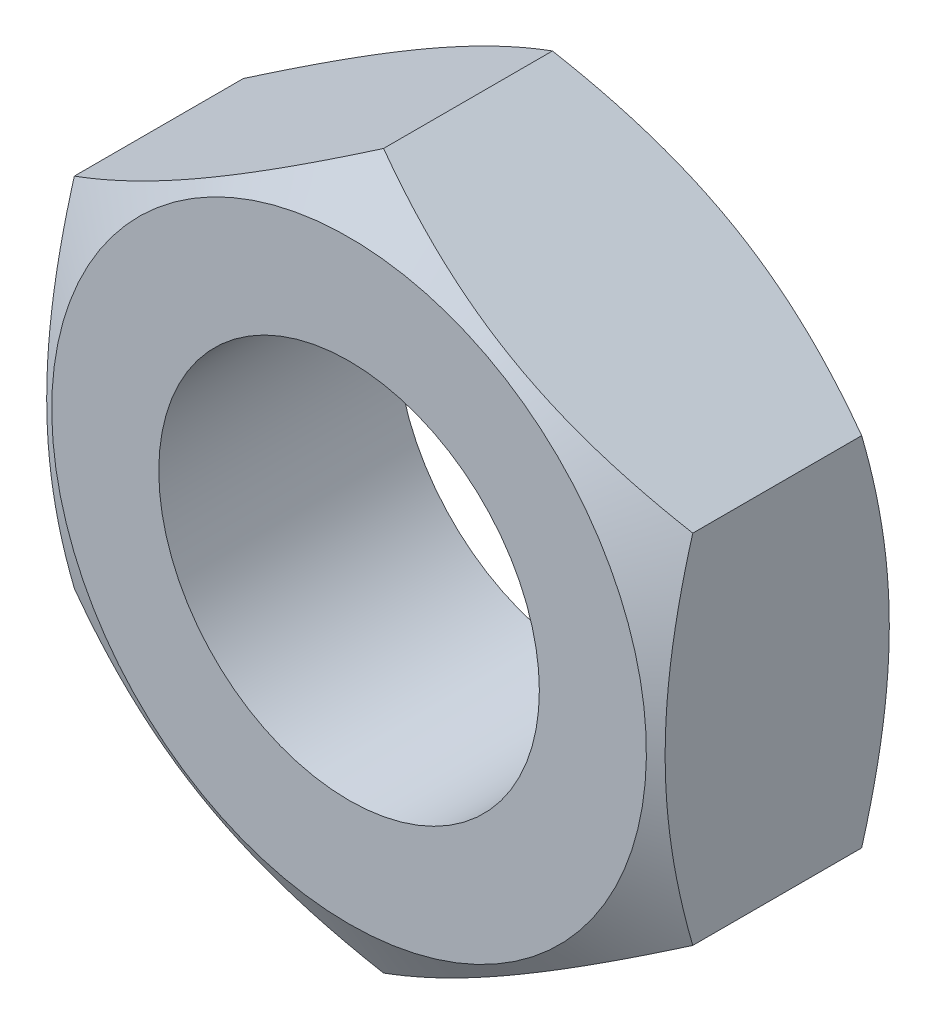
ISO-10303-21;
HEADER;
FILE_DESCRIPTION(('STEP AP214'),'2;1');
FILE_NAME('part.step','',(''),(''),'','','');
FILE_SCHEMA(('AUTOMOTIVE_DESIGN { 1 0 10303 214 1 1 1 1 }'));
ENDSEC;
DATA;
#1=APPLICATION_CONTEXT('core data for automotive mechanical design processes');
#2=APPLICATION_PROTOCOL_DEFINITION('international standard','automotive_design',2000,#1);
#3=PRODUCT_CONTEXT('',#1,'mechanical');
#4=PRODUCT('Part','Part','',(#3));
#5=PRODUCT_RELATED_PRODUCT_CATEGORY('part','',(#4));
#6=PRODUCT_DEFINITION_FORMATION('','',#4);
#7=PRODUCT_DEFINITION_CONTEXT('part definition',#1,'design');
#8=PRODUCT_DEFINITION('design','',#6,#7);
#9=PRODUCT_DEFINITION_SHAPE('','',#8);
#10=(LENGTH_UNIT() NAMED_UNIT(*) SI_UNIT(.MILLI.,.METRE.));
#11=(NAMED_UNIT(*) PLANE_ANGLE_UNIT() SI_UNIT($,.RADIAN.));
#12=(NAMED_UNIT(*) SI_UNIT($,.STERADIAN.) SOLID_ANGLE_UNIT());
#13=UNCERTAINTY_MEASURE_WITH_UNIT(LENGTH_MEASURE(1.E-05),#10,'distance_accuracy_value','');
#14=(GEOMETRIC_REPRESENTATION_CONTEXT(3) GLOBAL_UNCERTAINTY_ASSIGNED_CONTEXT((#13)) GLOBAL_UNIT_ASSIGNED_CONTEXT((#10,
#11,#12)) REPRESENTATION_CONTEXT('',''));
#15=CARTESIAN_POINT('',(0.,0.,0.));
#16=DIRECTION('',(0.,0.,1.));
#17=DIRECTION('',(1.,0.,0.));
#18=AXIS2_PLACEMENT_3D('',#15,#16,#17);
#19=CARTESIAN_POINT('',(-6.5,-3.75277674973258,6.5));
#20=DIRECTION('',(-1.,0.,0.));
#21=DIRECTION('',(0.,0.,1.));
#22=AXIS2_PLACEMENT_3D('',#19,#20,#21);
#23=PLANE('',#22);
#24=CARTESIAN_POINT('',(-6.5,-9.98161632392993,1.73135975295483));
#25=CARTESIAN_POINT('',(-6.5,-9.69852854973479,1.86828240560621));
#26=CARTESIAN_POINT('',(-6.5,-9.414780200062,2.00386324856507));
#27=CARTESIAN_POINT('',(-6.5,-8.84561064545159,2.27158457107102));
#28=CARTESIAN_POINT('',(-6.5,-8.56018917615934,2.4037244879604));
#29=CARTESIAN_POINT('',(-6.5,-7.98580311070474,2.66449331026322));
#30=CARTESIAN_POINT('',(-6.5,-7.69682761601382,2.79309829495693));
#31=CARTESIAN_POINT('',(-6.5,-7.11654332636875,3.04491136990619));
#32=CARTESIAN_POINT('',(-6.5,-6.82523464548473,3.16811972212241));
#33=CARTESIAN_POINT('',(-6.5,-6.23081437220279,3.41139721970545));
#34=CARTESIAN_POINT('',(-6.5,-5.92761517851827,3.53125353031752));
#35=CARTESIAN_POINT('',(-6.5,-5.31763401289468,3.76165336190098));
#36=CARTESIAN_POINT('',(-6.5,-5.01085163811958,3.87219582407));
#37=CARTESIAN_POINT('',(-6.5,-4.39381921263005,4.08099296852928));
#38=CARTESIAN_POINT('',(-6.5,-4.08357797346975,4.17927340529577));
#39=CARTESIAN_POINT('',(-6.5,-3.4586584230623,4.36032946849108));
#40=CARTESIAN_POINT('',(-6.5,-3.14398157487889,4.4431100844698));
#41=CARTESIAN_POINT('',(-6.5,-2.51168245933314,4.58868976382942));
#42=CARTESIAN_POINT('',(-6.5,-2.19408488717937,4.65159314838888));
#43=CARTESIAN_POINT('',(-6.5,-1.71487680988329,4.72826766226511));
#44=CARTESIAN_POINT('',(-6.5,-1.55465944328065,4.75088015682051));
#45=CARTESIAN_POINT('',(-6.5,-1.23346313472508,4.78976589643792));
#46=CARTESIAN_POINT('',(-6.5,-1.0724842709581,4.80603977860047));
#47=CARTESIAN_POINT('',(-6.5,-0.752038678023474,4.83172518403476));
#48=CARTESIAN_POINT('',(-6.5,-0.592578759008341,4.84122135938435));
#49=CARTESIAN_POINT('',(-6.5,-0.27340062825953,4.85346937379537));
#50=CARTESIAN_POINT('',(-6.5,-0.113682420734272,4.85622132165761));
#51=CARTESIAN_POINT('',(-6.5,0.205728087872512,4.85491540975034));
#52=CARTESIAN_POINT('',(-6.5,0.365420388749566,4.85085749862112));
#53=CARTESIAN_POINT('',(-6.5,0.684495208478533,4.83602921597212));
#54=CARTESIAN_POINT('',(-6.5,0.843877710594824,4.82525849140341));
#55=CARTESIAN_POINT('',(-6.5,1.22996758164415,4.79126101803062));
#56=CARTESIAN_POINT('',(-6.5,1.45638554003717,4.76468045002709));
#57=CARTESIAN_POINT('',(-6.5,1.90746467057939,4.69944596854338));
#58=CARTESIAN_POINT('',(-6.5,2.1321255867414,4.66079032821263));
#59=CARTESIAN_POINT('',(-6.5,2.80325882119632,4.5287671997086));
#60=CARTESIAN_POINT('',(-6.5,3.24661528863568,4.41936998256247));
#61=CARTESIAN_POINT('',(-6.5,3.90942824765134,4.23063137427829));
#62=CARTESIAN_POINT('',(-6.5,4.1323463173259,4.16275540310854));
#63=CARTESIAN_POINT('',(-6.5,4.57601591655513,4.02019482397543));
#64=CARTESIAN_POINT('',(-6.5,4.79676743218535,3.94551017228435));
#65=CARTESIAN_POINT('',(-6.5,5.23617812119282,3.79051034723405));
#66=CARTESIAN_POINT('',(-6.5,5.4548380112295,3.71019718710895));
#67=CARTESIAN_POINT('',(-6.5,5.89036250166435,3.54486115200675));
#68=CARTESIAN_POINT('',(-6.5,6.10722711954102,3.4598383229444));
#69=CARTESIAN_POINT('',(-6.5,6.60378303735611,3.25993527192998));
#70=CARTESIAN_POINT('',(-6.5,6.8829317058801,3.14370996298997));
#71=CARTESIAN_POINT('',(-6.5,7.438984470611,2.90599503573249));
#72=CARTESIAN_POINT('',(-6.5,7.71588845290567,2.78450515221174));
#73=CARTESIAN_POINT('',(-6.5,8.26784706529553,2.53727897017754));
#74=CARTESIAN_POINT('',(-6.5,8.54290136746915,2.41154194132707));
#75=CARTESIAN_POINT('',(-6.5,9.09141569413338,2.15663242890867));
#76=CARTESIAN_POINT('',(-6.5,9.36487568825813,2.0274598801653));
#77=CARTESIAN_POINT('',(-6.5,10.1837305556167,1.63552392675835));
#78=CARTESIAN_POINT('',(-6.5,10.7271149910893,1.36856241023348));
#79=CARTESIAN_POINT('',(-6.5,11.8100422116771,0.826959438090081));
#80=CARTESIAN_POINT('',(-6.5,12.3495848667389,0.552317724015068));
#81=CARTESIAN_POINT('',(-6.5,13.1354553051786,0.147197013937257));
#82=CARTESIAN_POINT('',(-6.5,13.3829075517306,0.0188929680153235));
#83=CARTESIAN_POINT('',(-6.5,13.8772755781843,-0.238734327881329));
#84=CARTESIAN_POINT('',(-6.5,14.1241913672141,-0.368057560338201));
#85=CARTESIAN_POINT('',(-6.5,14.8642590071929,-0.75736353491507));
#86=CARTESIAN_POINT('',(-6.5,15.356712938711,-1.01867315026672));
#87=CARTESIAN_POINT('',(-6.5,16.3390648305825,-1.54341314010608));
#88=CARTESIAN_POINT('',(-6.5,16.8289660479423,-1.80683742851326));
#89=CARTESIAN_POINT('',(-6.5,17.807579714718,-2.33582775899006));
#90=CARTESIAN_POINT('',(-6.5,18.2962922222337,-2.60139369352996));
#91=CARTESIAN_POINT('',(-6.5,18.7845625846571,-2.86776506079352));
#92=B_SPLINE_CURVE_WITH_KNOTS('',3,(#24,#25,#26,#27,#28,#29,#30,#31,#32,#33,#34,#35,#36,#37,#38,
#39,#40,#41,#42,#43,#44,#45,#46,#47,#48,#49,#50,#51,#52,#53,#54,#55,#56,#57,#58,#59,#60,#61,#62,
#63,#64,#65,#66,#67,#68,#69,#70,#71,#72,#73,#74,#75,#76,#77,#78,#79,#80,#81,#82,#83,#84,#85,#86,
#87,#88,#89,#90,#91),.UNSPECIFIED.,.F.,.F.,(4,2,2,2,2,2,2,2,2,2,2,2,2,2,2,2,2,2,2,2,2,2,2,2,2,2,
2,2,2,2,2,2,2,4),(0.,0.94339873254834,1.88695077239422,2.83580845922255,3.78462003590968,
4.76259011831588,5.74067122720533,6.71666215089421,7.69233835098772,8.66280545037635,
9.14811540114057,9.63337656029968,10.1124655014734,10.5915467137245,11.0706315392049,
11.549741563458,12.2332717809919,12.9168997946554,14.284955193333,14.9839684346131,
15.6829861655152,16.3817551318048,17.0805172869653,17.9875793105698,18.8946870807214,
19.8019516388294,20.7092334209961,22.5253954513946,24.3416186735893,25.1778289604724,
26.0140249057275,27.6864782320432,29.3551728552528,31.0237842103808),.UNSPECIFIED.);
#93=CARTESIAN_POINT('',(-6.5,3.75277674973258,4.27510584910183));
#94=VERTEX_POINT('',#93);
#95=CARTESIAN_POINT('',(-6.5,-3.75277674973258,4.27510584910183));
#96=VERTEX_POINT('',#95);
#97=EDGE_CURVE('E74',#94,#96,#92,.F.);
#98=ORIENTED_EDGE('',*,*,#97,.F.);
#99=DIRECTION('',(0.,0.,-1.));
#100=VECTOR('',#99,1.);
#101=CARTESIAN_POINT('',(-6.5,3.75277674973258,6.5));
#102=LINE('',#101,#100);
#103=CARTESIAN_POINT('',(-6.5,3.75277674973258,0.724894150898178));
#104=VERTEX_POINT('',#103);
#105=EDGE_CURVE('E43',#94,#104,#102,.T.);
#106=ORIENTED_EDGE('',*,*,#105,.T.);
#107=CARTESIAN_POINT('',(-6.5,-10.0118859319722,3.28329160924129));
#108=CARTESIAN_POINT('',(-6.5,-9.72855336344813,3.14612691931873));
#109=CARTESIAN_POINT('',(-6.5,-9.44456295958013,3.01029742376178));
#110=CARTESIAN_POINT('',(-6.5,-8.87491638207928,2.74206118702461));
#111=CARTESIAN_POINT('',(-6.5,-8.58925994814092,2.60965499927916));
#112=CARTESIAN_POINT('',(-6.5,-8.01442627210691,2.34833687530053));
#113=CARTESIAN_POINT('',(-6.5,-7.72523828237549,2.21944849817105));
#114=CARTESIAN_POINT('',(-6.5,-7.14453800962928,1.96703882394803));
#115=CARTESIAN_POINT('',(-6.5,-6.85302583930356,1.84351726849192));
#116=CARTESIAN_POINT('',(-6.5,-6.25807741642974,1.59951345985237));
#117=CARTESIAN_POINT('',(-6.5,-5.95455264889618,1.47924583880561));
#118=CARTESIAN_POINT('',(-6.5,-5.34392655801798,1.24798011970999));
#119=CARTESIAN_POINT('',(-6.5,-5.03682483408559,1.13698307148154));
#120=CARTESIAN_POINT('',(-6.5,-4.41915477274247,0.927222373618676));
#121=CARTESIAN_POINT('',(-6.5,-4.10859513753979,0.828433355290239));
#122=CARTESIAN_POINT('',(-6.5,-3.48301880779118,0.646304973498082));
#123=CARTESIAN_POINT('',(-6.5,-3.16800357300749,0.562960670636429));
#124=CARTESIAN_POINT('',(-6.5,-2.53508513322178,0.416201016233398));
#125=CARTESIAN_POINT('',(-6.5,-2.21720674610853,0.352680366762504));
#126=CARTESIAN_POINT('',(-6.5,-1.577525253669,0.249221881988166));
#127=CARTESIAN_POINT('',(-6.5,-1.2557225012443,0.209281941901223));
#128=CARTESIAN_POINT('',(-6.5,-0.773490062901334,0.169711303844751));
#129=CARTESIAN_POINT('',(-6.5,-0.61385405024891,0.159910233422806));
#130=CARTESIAN_POINT('',(-6.5,-0.294303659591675,0.147056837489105));
#131=CARTESIAN_POINT('',(-6.5,-0.134389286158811,0.144004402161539));
#132=CARTESIAN_POINT('',(-6.5,0.185423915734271,0.144728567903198));
#133=CARTESIAN_POINT('',(-6.5,0.345322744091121,0.148505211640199));
#134=CARTESIAN_POINT('',(-6.5,0.66482175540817,0.16279442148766));
#135=CARTESIAN_POINT('',(-6.5,0.824421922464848,0.173307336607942));
#136=CARTESIAN_POINT('',(-6.5,1.21009106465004,0.206631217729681));
#137=CARTESIAN_POINT('',(-6.5,1.43587954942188,0.232755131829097));
#138=CARTESIAN_POINT('',(-6.5,1.88572477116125,0.297044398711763));
#139=CARTESIAN_POINT('',(-6.5,2.10978125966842,0.335211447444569));
#140=CARTESIAN_POINT('',(-6.5,2.77912789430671,0.465748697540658));
#141=CARTESIAN_POINT('',(-6.5,3.22133379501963,0.574129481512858));
#142=CARTESIAN_POINT('',(-6.5,3.88246330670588,0.76136414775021));
#143=CARTESIAN_POINT('',(-6.5,4.10483365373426,0.828741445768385));
#144=CARTESIAN_POINT('',(-6.5,4.54741339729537,0.970317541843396));
#145=CARTESIAN_POINT('',(-6.5,4.76762277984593,1.04451638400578));
#146=CARTESIAN_POINT('',(-6.5,5.20595333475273,1.19855980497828));
#147=CARTESIAN_POINT('',(-6.5,5.42407520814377,1.27840240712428));
#148=CARTESIAN_POINT('',(-6.5,5.85852369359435,1.4428115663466));
#149=CARTESIAN_POINT('',(-6.5,6.07485032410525,1.5273780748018));
#150=CARTESIAN_POINT('',(-6.5,6.57455675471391,1.7280091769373));
#151=CARTESIAN_POINT('',(-6.5,6.85735139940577,1.84552826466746));
#152=CARTESIAN_POINT('',(-6.5,7.42062861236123,2.08599704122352));
#153=CARTESIAN_POINT('',(-6.5,7.70111105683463,2.20894701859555));
#154=CARTESIAN_POINT('',(-6.5,8.26017575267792,2.45921670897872));
#155=CARTESIAN_POINT('',(-6.5,8.53875764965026,2.58653721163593));
#156=CARTESIAN_POINT('',(-6.5,9.09428863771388,2.84469787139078));
#157=CARTESIAN_POINT('',(-6.5,9.3712376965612,2.97553809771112));
#158=CARTESIAN_POINT('',(-6.5,9.92401115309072,3.24021331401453));
#159=CARTESIAN_POINT('',(-6.5,10.199834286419,3.37405094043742));
#160=CARTESIAN_POINT('',(-6.5,10.750313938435,3.64410623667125));
#161=CARTESIAN_POINT('',(-6.5,11.0249704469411,3.78032392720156));
#162=CARTESIAN_POINT('',(-6.5,11.8474745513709,4.19193510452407));
#163=CARTESIAN_POINT('',(-6.5,12.3938452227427,4.47028114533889));
#164=CARTESIAN_POINT('',(-6.5,13.189271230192,4.88066012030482));
#165=CARTESIAN_POINT('',(-6.5,13.4394696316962,5.01049135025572));
#166=CARTESIAN_POINT('',(-6.5,13.9393233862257,5.27118553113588));
#167=CARTESIAN_POINT('',(-6.5,14.1889787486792,5.40204846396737));
#168=CARTESIAN_POINT('',(-6.5,14.9372586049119,5.79598704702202));
#169=CARTESIAN_POINT('',(-6.5,15.4351776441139,6.0604025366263));
#170=CARTESIAN_POINT('',(-6.5,16.4283993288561,6.59135046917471));
#171=CARTESIAN_POINT('',(-6.5,16.9237053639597,6.85787658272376));
#172=CARTESIAN_POINT('',(-6.5,17.9131191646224,7.3930841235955));
#173=CARTESIAN_POINT('',(-6.5,18.4072269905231,7.66176543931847));
#174=CARTESIAN_POINT('',(-6.5,18.9008904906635,7.93125551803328));
#175=B_SPLINE_CURVE_WITH_KNOTS('',3,(#107,#108,#109,#110,#111,#112,#113,#114,#115,#116,#117,
#118,#119,#120,#121,#122,#123,#124,#125,#126,#127,#128,#129,#130,#131,#132,#133,#134,#135,#136,
#137,#138,#139,#140,#141,#142,#143,#144,#145,#146,#147,#148,#149,#150,#151,#152,#153,#154,#155,
#156,#157,#158,#159,#160,#161,#162,#163,#164,#165,#166,#167,#168,#169,#170,#171,#172,#173,#174),
.UNSPECIFIED.,.F.,.F.,(4,2,2,2,2,2,2,2,2,2,2,2,2,2,2,2,2,2,2,2,2,2,2,2,2,2,2,2,2,2,2,2,2,4),(0.,
0.944375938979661,1.88890360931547,2.83869006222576,3.78843074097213,4.76776487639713,
5.74720976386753,6.72458382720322,7.7016447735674,8.67342384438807,9.64511616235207,
10.1248049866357,10.6044860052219,11.0841700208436,11.5638788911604,12.2453767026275,
12.9269705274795,14.2909426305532,14.9879481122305,15.6849581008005,16.3817251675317,
17.0784850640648,17.9971327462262,18.9158292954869,19.8346927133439,20.753574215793,
21.6732984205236,22.5930306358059,24.4325333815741,25.2781675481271,26.1237869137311,
27.8150905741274,29.5024730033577,31.1897686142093),.UNSPECIFIED.);
#176=CARTESIAN_POINT('',(-6.5,-3.75277674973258,0.724894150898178));
#177=VERTEX_POINT('',#176);
#178=EDGE_CURVE('E92',#177,#104,#175,.T.);
#179=ORIENTED_EDGE('',*,*,#178,.F.);
#180=DIRECTION('',(0.,0.,-1.));
#181=VECTOR('',#180,1.);
#182=CARTESIAN_POINT('',(-6.5,-3.75277674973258,6.5));
#183=LINE('',#182,#181);
#184=EDGE_CURVE('E29',#96,#177,#183,.T.);
#185=ORIENTED_EDGE('',*,*,#184,.F.);
#186=EDGE_LOOP('',(#98,#106,#179,#185));
#187=FACE_BOUND('',#186,.T.);
#188=ADVANCED_FACE('F14',(#187),#23,.T.);
#189=CARTESIAN_POINT('',(-6.5,-3.75277674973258,6.5));
#190=DIRECTION('',(0.5,0.866025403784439,0.));
#191=DIRECTION('',(-0.866025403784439,0.5,0.));
#192=AXIS2_PLACEMENT_3D('',#189,#190,#191);
#193=PLANE('',#192);
#194=DIRECTION('',(0.,0.,-1.));
#195=VECTOR('',#194,1.);
#196=CARTESIAN_POINT('',(0.,-7.50555349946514,6.5));
#197=LINE('',#196,#195);
#198=CARTESIAN_POINT('',(0.,-7.50555349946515,4.27510584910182));
#199=VERTEX_POINT('',#198);
#200=CARTESIAN_POINT('',(0.,-7.50555349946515,0.724894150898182));
#201=VERTEX_POINT('',#200);
#202=EDGE_CURVE('E99',#199,#201,#197,.T.);
#203=ORIENTED_EDGE('',*,*,#202,.F.);
#204=CARTESIAN_POINT('',(0.00019999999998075,-7.50566896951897,4.27503918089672));
#205=CARTESIAN_POINT('',(-0.142677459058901,-7.4231786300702,4.32265800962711));
#206=CARTESIAN_POINT('',(-0.286087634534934,-7.34038072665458,4.36811573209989));
#207=CARTESIAN_POINT('',(-0.574072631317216,-7.17411251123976,4.45411375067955));
#208=CARTESIAN_POINT('',(-0.718647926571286,-7.09064192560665,4.49465192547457));
#209=CARTESIAN_POINT('',(-1.15468865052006,-6.83889369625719,4.60809143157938));
#210=CARTESIAN_POINT('',(-1.44787528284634,-6.66962231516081,4.67261462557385));
#211=CARTESIAN_POINT('',(-1.8866237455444,-6.41631077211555,4.7482758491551));
#212=CARTESIAN_POINT('',(-2.03087463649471,-6.33302748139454,4.7698295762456));
#213=CARTESIAN_POINT('',(-2.32002821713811,-6.16608458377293,4.80597211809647));
#214=CARTESIAN_POINT('',(-2.46493084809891,-6.08242501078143,4.82056154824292));
#215=CARTESIAN_POINT('',(-2.75498777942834,-5.91496056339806,4.84240368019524));
#216=CARTESIAN_POINT('',(-2.90014160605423,-5.8311559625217,4.84966470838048));
#217=CARTESIAN_POINT('',(-3.19057533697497,-5.66347396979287,4.85670213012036));
#218=CARTESIAN_POINT('',(-3.33585523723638,-5.5795965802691,4.85647875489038));
#219=CARTESIAN_POINT('',(-3.73387594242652,-5.34979921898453,4.84557897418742));
#220=CARTESIAN_POINT('',(-3.98648646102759,-5.20395446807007,4.82728061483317));
#221=CARTESIAN_POINT('',(-4.49002967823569,-4.91323365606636,4.76925609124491));
#222=CARTESIAN_POINT('',(-4.7409606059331,-4.76835861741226,4.72951009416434));
#223=CARTESIAN_POINT('',(-5.24551722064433,-4.47705272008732,4.63015652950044));
#224=CARTESIAN_POINT('',(-5.49907924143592,-4.33065861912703,4.57012800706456));
#225=CARTESIAN_POINT('',(-6.00242193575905,-4.04005357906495,4.43388744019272));
#226=CARTESIAN_POINT('',(-6.25220905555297,-3.89583891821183,4.35770739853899));
#227=CARTESIAN_POINT('',(-6.5002,-3.75266127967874,4.27503918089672));
#228=B_SPLINE_CURVE_WITH_KNOTS('',3,(#204,#205,#206,#207,#208,#209,#210,#211,#212,#213,#214,
#215,#216,#217,#218,#219,#220,#221,#222,#223,#224,#225,#226,#227),.UNSPECIFIED.,.F.,.F.,(4,2,2,
2,2,2,2,2,2,2,2,4),(0.,0.515105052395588,1.03043143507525,2.06322554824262,2.56697389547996,
3.07067772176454,3.57380860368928,4.0769239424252,4.9527935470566,5.82947446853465,
6.72559912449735,7.61996451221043),.UNSPECIFIED.);
#229=EDGE_CURVE('E80',#199,#96,#228,.T.);
#230=ORIENTED_EDGE('',*,*,#229,.T.);
#231=ORIENTED_EDGE('',*,*,#184,.T.);
#232=CARTESIAN_POINT('',(-6.5002,-3.75266127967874,0.724960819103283));
#233=CARTESIAN_POINT('',(-6.35732254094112,-3.83515161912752,0.677341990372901));
#234=CARTESIAN_POINT('',(-6.21391236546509,-3.91794952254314,0.631884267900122));
#235=CARTESIAN_POINT('',(-5.9259273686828,-4.08421773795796,0.54588624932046));
#236=CARTESIAN_POINT('',(-5.78135207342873,-4.16768832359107,0.505348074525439));
#237=CARTESIAN_POINT('',(-5.34531134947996,-4.41943655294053,0.391908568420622));
#238=CARTESIAN_POINT('',(-5.05212471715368,-4.58870793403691,0.327385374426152));
#239=CARTESIAN_POINT('',(-4.61337625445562,-4.84201947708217,0.251724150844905));
#240=CARTESIAN_POINT('',(-4.4691253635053,-4.92530276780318,0.230170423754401));
#241=CARTESIAN_POINT('',(-4.1799717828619,-5.09224566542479,0.194027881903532));
#242=CARTESIAN_POINT('',(-4.0350691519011,-5.17590523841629,0.17943845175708));
#243=CARTESIAN_POINT('',(-3.74501222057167,-5.34336968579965,0.157596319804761));
#244=CARTESIAN_POINT('',(-3.59985839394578,-5.42717428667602,0.150335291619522));
#245=CARTESIAN_POINT('',(-3.30942466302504,-5.59485627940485,0.143297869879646));
#246=CARTESIAN_POINT('',(-3.16414476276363,-5.67873366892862,0.143521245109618));
#247=CARTESIAN_POINT('',(-2.7661240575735,-5.90853103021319,0.154421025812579));
#248=CARTESIAN_POINT('',(-2.51351353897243,-6.05437578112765,0.172719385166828));
#249=CARTESIAN_POINT('',(-2.00997032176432,-6.34509659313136,0.230743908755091));
#250=CARTESIAN_POINT('',(-1.75903939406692,-6.48997163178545,0.27048990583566));
#251=CARTESIAN_POINT('',(-1.25448277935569,-6.78127752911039,0.369843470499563));
#252=CARTESIAN_POINT('',(-1.0009207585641,-6.92767163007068,0.429871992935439));
#253=CARTESIAN_POINT('',(-0.497578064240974,-7.21827667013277,0.56611255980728));
#254=CARTESIAN_POINT('',(-0.247790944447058,-7.36249133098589,0.642292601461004));
#255=CARTESIAN_POINT('',(0.000199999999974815,-7.50566896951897,0.724960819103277));
#256=B_SPLINE_CURVE_WITH_KNOTS('',3,(#232,#233,#234,#235,#236,#237,#238,#239,#240,#241,#242,
#243,#244,#245,#246,#247,#248,#249,#250,#251,#252,#253,#254,#255),.UNSPECIFIED.,.F.,.F.,(4,2,2,
2,2,2,2,2,2,2,2,4),(0.,0.515105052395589,1.03043143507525,2.06322554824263,2.56697389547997,
3.07067772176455,3.57380860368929,4.07692394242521,4.9527935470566,5.82947446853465,
6.72559912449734,7.61996451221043),.UNSPECIFIED.);
#257=EDGE_CURVE('E164',#177,#201,#256,.T.);
#258=ORIENTED_EDGE('',*,*,#257,.T.);
#259=EDGE_LOOP('',(#203,#230,#231,#258));
#260=FACE_BOUND('',#259,.T.);
#261=ADVANCED_FACE('F16',(#260),#193,.F.);
#262=CARTESIAN_POINT('',(6.5,-3.75277674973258,6.5));
#263=DIRECTION('',(0.5,-0.86602540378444,0.));
#264=DIRECTION('',(0.86602540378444,0.5,0.));
#265=AXIS2_PLACEMENT_3D('',#262,#263,#264);
#266=PLANE('',#265);
#267=CARTESIAN_POINT('',(-0.000200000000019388,-7.50566896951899,4.27503918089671));
#268=CARTESIAN_POINT('',(0.14267745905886,-7.42317863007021,4.3226580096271));
#269=CARTESIAN_POINT('',(0.286087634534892,-7.34038072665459,4.36811573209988));
#270=CARTESIAN_POINT('',(0.574072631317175,-7.17411251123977,4.45411375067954));
#271=CARTESIAN_POINT('',(0.718647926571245,-7.09064192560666,4.49465192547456));
#272=CARTESIAN_POINT('',(1.15468865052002,-6.8388936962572,4.60809143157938));
#273=CARTESIAN_POINT('',(1.4478752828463,-6.66962231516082,4.67261462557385));
#274=CARTESIAN_POINT('',(1.88662374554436,-6.41631077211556,4.7482758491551));
#275=CARTESIAN_POINT('',(2.03087463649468,-6.33302748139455,4.7698295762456));
#276=CARTESIAN_POINT('',(2.32002821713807,-6.16608458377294,4.80597211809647));
#277=CARTESIAN_POINT('',(2.46493084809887,-6.08242501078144,4.82056154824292));
#278=CARTESIAN_POINT('',(2.75498777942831,-5.91496056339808,4.84240368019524));
#279=CARTESIAN_POINT('',(2.9001416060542,-5.83115596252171,4.84966470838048));
#280=CARTESIAN_POINT('',(3.19057533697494,-5.66347396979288,4.85670213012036));
#281=CARTESIAN_POINT('',(3.33585523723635,-5.57959658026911,4.85647875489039));
#282=CARTESIAN_POINT('',(3.73387594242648,-5.34979921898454,4.84557897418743));
#283=CARTESIAN_POINT('',(3.98648646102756,-5.20395446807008,4.82728061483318));
#284=CARTESIAN_POINT('',(4.49002967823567,-4.91323365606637,4.76925609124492));
#285=CARTESIAN_POINT('',(4.74096060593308,-4.76835861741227,4.72951009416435));
#286=CARTESIAN_POINT('',(5.24551722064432,-4.47705272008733,4.63015652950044));
#287=CARTESIAN_POINT('',(5.49907924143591,-4.33065861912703,4.57012800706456));
#288=CARTESIAN_POINT('',(6.00242193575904,-4.04005357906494,4.43388744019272));
#289=CARTESIAN_POINT('',(6.25220905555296,-3.89583891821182,4.357707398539));
#290=CARTESIAN_POINT('',(6.5002,-3.75266127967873,4.27503918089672));
#291=B_SPLINE_CURVE_WITH_KNOTS('',3,(#267,#268,#269,#270,#271,#272,#273,#274,#275,#276,#277,
#278,#279,#280,#281,#282,#283,#284,#285,#286,#287,#288,#289,#290),.UNSPECIFIED.,.F.,.F.,(4,2,2,
2,2,2,2,2,2,2,2,4),(0.,0.515105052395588,1.03043143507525,2.06322554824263,2.56697389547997,
3.07067772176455,3.57380860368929,4.07692394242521,4.95279354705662,5.82947446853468,
6.72559912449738,7.61996451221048),.UNSPECIFIED.);
#292=CARTESIAN_POINT('',(6.5,-3.75277674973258,4.27510584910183));
#293=VERTEX_POINT('',#292);
#294=EDGE_CURVE('E135',#199,#293,#291,.T.);
#295=ORIENTED_EDGE('',*,*,#294,.F.);
#296=ORIENTED_EDGE('',*,*,#202,.T.);
#297=CARTESIAN_POINT('',(6.5002,-3.75266127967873,0.724960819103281));
#298=CARTESIAN_POINT('',(6.35732254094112,-3.83515161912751,0.677341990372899));
#299=CARTESIAN_POINT('',(6.21391236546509,-3.91794952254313,0.63188426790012));
#300=CARTESIAN_POINT('',(5.9259273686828,-4.08421773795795,0.545886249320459));
#301=CARTESIAN_POINT('',(5.78135207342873,-4.16768832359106,0.505348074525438));
#302=CARTESIAN_POINT('',(5.34531134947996,-4.41943655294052,0.39190856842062));
#303=CARTESIAN_POINT('',(5.05212471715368,-4.5887079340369,0.327385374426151));
#304=CARTESIAN_POINT('',(4.61337625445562,-4.84201947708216,0.251724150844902));
#305=CARTESIAN_POINT('',(4.4691253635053,-4.92530276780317,0.230170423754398));
#306=CARTESIAN_POINT('',(4.17997178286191,-5.09224566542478,0.194027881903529));
#307=CARTESIAN_POINT('',(4.0350691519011,-5.17590523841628,0.179438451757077));
#308=CARTESIAN_POINT('',(3.74501222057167,-5.34336968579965,0.157596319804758));
#309=CARTESIAN_POINT('',(3.59985839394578,-5.42717428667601,0.150335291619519));
#310=CARTESIAN_POINT('',(3.30942466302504,-5.59485627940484,0.143297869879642));
#311=CARTESIAN_POINT('',(3.16414476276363,-5.67873366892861,0.143521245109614));
#312=CARTESIAN_POINT('',(2.7661240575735,-5.90853103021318,0.154421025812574));
#313=CARTESIAN_POINT('',(2.51351353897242,-6.05437578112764,0.172719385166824));
#314=CARTESIAN_POINT('',(2.00997032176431,-6.34509659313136,0.230743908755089));
#315=CARTESIAN_POINT('',(1.7590393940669,-6.48997163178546,0.270489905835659));
#316=CARTESIAN_POINT('',(1.25448277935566,-6.7812775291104,0.369843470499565));
#317=CARTESIAN_POINT('',(1.00092075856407,-6.92767163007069,0.429871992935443));
#318=CARTESIAN_POINT('',(0.497578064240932,-7.21827667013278,0.566112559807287));
#319=CARTESIAN_POINT('',(0.247790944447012,-7.3624913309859,0.642292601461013));
#320=CARTESIAN_POINT('',(-0.000200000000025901,-7.50566896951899,0.724960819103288));
#321=B_SPLINE_CURVE_WITH_KNOTS('',3,(#297,#298,#299,#300,#301,#302,#303,#304,#305,#306,#307,
#308,#309,#310,#311,#312,#313,#314,#315,#316,#317,#318,#319,#320),.UNSPECIFIED.,.F.,.F.,(4,2,2,
2,2,2,2,2,2,2,2,4),(0.,0.515105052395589,1.03043143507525,2.06322554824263,2.56697389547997,
3.07067772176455,3.57380860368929,4.07692394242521,4.95279354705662,5.82947446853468,
6.72559912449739,7.61996451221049),.UNSPECIFIED.);
#322=CARTESIAN_POINT('',(6.5,-3.75277674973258,0.724894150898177));
#323=VERTEX_POINT('',#322);
#324=EDGE_CURVE('E196',#323,#201,#321,.T.);
#325=ORIENTED_EDGE('',*,*,#324,.F.);
#326=DIRECTION('',(0.,0.,-1.));
#327=VECTOR('',#326,1.);
#328=CARTESIAN_POINT('',(6.5,-3.75277674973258,6.5));
#329=LINE('',#328,#327);
#330=EDGE_CURVE('E97',#293,#323,#329,.T.);
#331=ORIENTED_EDGE('',*,*,#330,.F.);
#332=EDGE_LOOP('',(#295,#296,#325,#331));
#333=FACE_BOUND('',#332,.T.);
#334=ADVANCED_FACE('F202',(#333),#266,.T.);
#335=CARTESIAN_POINT('',(6.5,-3.75277674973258,6.5));
#336=DIRECTION('',(-1.,0.,0.));
#337=DIRECTION('',(0.,0.,1.));
#338=AXIS2_PLACEMENT_3D('',#335,#336,#337);
#339=PLANE('',#338);
#340=DIRECTION('',(0.,0.,-1.));
#341=VECTOR('',#340,1.);
#342=CARTESIAN_POINT('',(6.5,3.75277674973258,6.5));
#343=LINE('',#342,#341);
#344=CARTESIAN_POINT('',(6.5,3.75277674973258,4.27510584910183));
#345=VERTEX_POINT('',#344);
#346=CARTESIAN_POINT('',(6.5,3.75277674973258,0.724894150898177));
#347=VERTEX_POINT('',#346);
#348=EDGE_CURVE('E89',#345,#347,#343,.T.);
#349=ORIENTED_EDGE('',*,*,#348,.F.);
#350=CARTESIAN_POINT('',(6.5,-9.98161632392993,1.73135975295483));
#351=CARTESIAN_POINT('',(6.5,-9.69852854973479,1.86828240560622));
#352=CARTESIAN_POINT('',(6.5,-9.414780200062,2.00386324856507));
#353=CARTESIAN_POINT('',(6.5,-8.84561064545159,2.27158457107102));
#354=CARTESIAN_POINT('',(6.5,-8.56018917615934,2.4037244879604));
#355=CARTESIAN_POINT('',(6.5,-7.98580311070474,2.66449331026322));
#356=CARTESIAN_POINT('',(6.5,-7.69682761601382,2.79309829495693));
#357=CARTESIAN_POINT('',(6.5,-7.11654332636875,3.04491136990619));
#358=CARTESIAN_POINT('',(6.5,-6.82523464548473,3.16811972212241));
#359=CARTESIAN_POINT('',(6.5,-6.23081437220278,3.41139721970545));
#360=CARTESIAN_POINT('',(6.5,-5.92761517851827,3.53125353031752));
#361=CARTESIAN_POINT('',(6.5,-5.31763401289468,3.76165336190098));
#362=CARTESIAN_POINT('',(6.5,-5.01085163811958,3.87219582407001));
#363=CARTESIAN_POINT('',(6.5,-4.39381921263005,4.08099296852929));
#364=CARTESIAN_POINT('',(6.5,-4.08357797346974,4.17927340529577));
#365=CARTESIAN_POINT('',(6.5,-3.4586584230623,4.36032946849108));
#366=CARTESIAN_POINT('',(6.5,-3.14398157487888,4.4431100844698));
#367=CARTESIAN_POINT('',(6.5,-2.51168245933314,4.58868976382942));
#368=CARTESIAN_POINT('',(6.5,-2.19408488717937,4.65159314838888));
#369=CARTESIAN_POINT('',(6.5,-1.71487680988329,4.72826766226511));
#370=CARTESIAN_POINT('',(6.5,-1.55465944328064,4.75088015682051));
#371=CARTESIAN_POINT('',(6.5,-1.23346313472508,4.78976589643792));
#372=CARTESIAN_POINT('',(6.5,-1.07248427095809,4.80603977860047));
#373=CARTESIAN_POINT('',(6.5,-0.752038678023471,4.83172518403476));
#374=CARTESIAN_POINT('',(6.5,-0.592578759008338,4.84122135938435));
#375=CARTESIAN_POINT('',(6.5,-0.273400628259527,4.85346937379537));
#376=CARTESIAN_POINT('',(6.5,-0.113682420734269,4.85622132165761));
#377=CARTESIAN_POINT('',(6.5,0.205728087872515,4.85491540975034));
#378=CARTESIAN_POINT('',(6.5,0.365420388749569,4.85085749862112));
#379=CARTESIAN_POINT('',(6.5,0.684495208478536,4.83602921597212));
#380=CARTESIAN_POINT('',(6.5,0.843877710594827,4.82525849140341));
#381=CARTESIAN_POINT('',(6.5,1.22996758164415,4.79126101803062));
#382=CARTESIAN_POINT('',(6.5,1.45638554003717,4.76468045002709));
#383=CARTESIAN_POINT('',(6.5,1.90746467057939,4.69944596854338));
#384=CARTESIAN_POINT('',(6.5,2.1321255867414,4.66079032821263));
#385=CARTESIAN_POINT('',(6.5,2.80325882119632,4.5287671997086));
#386=CARTESIAN_POINT('',(6.5,3.24661528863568,4.41936998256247));
#387=CARTESIAN_POINT('',(6.5,3.90942824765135,4.23063137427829));
#388=CARTESIAN_POINT('',(6.5,4.13234631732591,4.16275540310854));
#389=CARTESIAN_POINT('',(6.5,4.57601591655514,4.02019482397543));
#390=CARTESIAN_POINT('',(6.5,4.79676743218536,3.94551017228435));
#391=CARTESIAN_POINT('',(6.5,5.23617812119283,3.79051034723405));
#392=CARTESIAN_POINT('',(6.5,5.4548380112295,3.71019718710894));
#393=CARTESIAN_POINT('',(6.5,5.89036250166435,3.54486115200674));
#394=CARTESIAN_POINT('',(6.5,6.10722711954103,3.4598383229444));
#395=CARTESIAN_POINT('',(6.5,6.60378303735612,3.25993527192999));
#396=CARTESIAN_POINT('',(6.5,6.8829317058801,3.14370996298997));
#397=CARTESIAN_POINT('',(6.5,7.438984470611,2.90599503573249));
#398=CARTESIAN_POINT('',(6.5,7.71588845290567,2.78450515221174));
#399=CARTESIAN_POINT('',(6.5,8.26784706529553,2.53727897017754));
#400=CARTESIAN_POINT('',(6.5,8.54290136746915,2.41154194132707));
#401=CARTESIAN_POINT('',(6.5,9.09141569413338,2.15663242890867));
#402=CARTESIAN_POINT('',(6.5,9.36487568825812,2.0274598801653));
#403=CARTESIAN_POINT('',(6.5,10.1837305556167,1.63552392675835));
#404=CARTESIAN_POINT('',(6.5,10.7271149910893,1.36856241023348));
#405=CARTESIAN_POINT('',(6.5,11.810042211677,0.826959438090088));
#406=CARTESIAN_POINT('',(6.5,12.3495848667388,0.552317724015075));
#407=CARTESIAN_POINT('',(6.5,13.1354553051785,0.147197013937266));
#408=CARTESIAN_POINT('',(6.5,13.3829075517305,0.0188929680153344));
#409=CARTESIAN_POINT('',(6.5,13.8772755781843,-0.238734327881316));
#410=CARTESIAN_POINT('',(6.5,14.1241913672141,-0.368057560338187));
#411=CARTESIAN_POINT('',(6.5,14.8642590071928,-0.757363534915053));
#412=CARTESIAN_POINT('',(6.5,15.3567129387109,-1.0186731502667));
#413=CARTESIAN_POINT('',(6.5,16.3390648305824,-1.54341314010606));
#414=CARTESIAN_POINT('',(6.5,16.8289660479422,-1.80683742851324));
#415=CARTESIAN_POINT('',(6.5,17.8075797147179,-2.33582775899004));
#416=CARTESIAN_POINT('',(6.5,18.2962922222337,-2.60139369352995));
#417=CARTESIAN_POINT('',(6.5,18.784562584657,-2.86776506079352));
#418=B_SPLINE_CURVE_WITH_KNOTS('',3,(#350,#351,#352,#353,#354,#355,#356,#357,#358,#359,#360,
#361,#362,#363,#364,#365,#366,#367,#368,#369,#370,#371,#372,#373,#374,#375,#376,#377,#378,#379,
#380,#381,#382,#383,#384,#385,#386,#387,#388,#389,#390,#391,#392,#393,#394,#395,#396,#397,#398,
#399,#400,#401,#402,#403,#404,#405,#406,#407,#408,#409,#410,#411,#412,#413,#414,#415,#416,#417),
.UNSPECIFIED.,.F.,.F.,(4,2,2,2,2,2,2,2,2,2,2,2,2,2,2,2,2,2,2,2,2,2,2,2,2,2,2,2,2,2,2,2,2,4),(0.,
0.943398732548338,1.88695077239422,2.83580845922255,3.78462003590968,4.76259011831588,
5.74067122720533,6.71666215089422,7.69233835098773,8.66280545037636,9.14811540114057,
9.63337656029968,10.1124655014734,10.5915467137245,11.0706315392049,11.549741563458,
12.2332717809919,12.9168997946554,14.284955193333,14.9839684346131,15.6829861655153,
16.3817551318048,17.0805172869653,17.9875793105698,18.8946870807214,19.8019516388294,
20.7092334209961,22.5253954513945,24.3416186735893,25.1778289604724,26.0140249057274,
27.6864782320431,29.3551728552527,31.0237842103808),.UNSPECIFIED.);
#419=EDGE_CURVE('E106',#345,#293,#418,.F.);
#420=ORIENTED_EDGE('',*,*,#419,.T.);
#421=ORIENTED_EDGE('',*,*,#330,.T.);
#422=CARTESIAN_POINT('',(6.5,-10.0118859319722,3.28329160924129));
#423=CARTESIAN_POINT('',(6.5,-9.72855336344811,3.14612691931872));
#424=CARTESIAN_POINT('',(6.5,-9.44456295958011,3.01029742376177));
#425=CARTESIAN_POINT('',(6.5,-8.87491638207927,2.7420611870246));
#426=CARTESIAN_POINT('',(6.5,-8.5892599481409,2.60965499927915));
#427=CARTESIAN_POINT('',(6.5,-8.01442627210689,2.34833687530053));
#428=CARTESIAN_POINT('',(6.5,-7.72523828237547,2.21944849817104));
#429=CARTESIAN_POINT('',(6.5,-7.14453800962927,1.96703882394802));
#430=CARTESIAN_POINT('',(6.5,-6.85302583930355,1.84351726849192));
#431=CARTESIAN_POINT('',(6.5,-6.25807741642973,1.59951345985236));
#432=CARTESIAN_POINT('',(6.5,-5.95455264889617,1.4792458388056));
#433=CARTESIAN_POINT('',(6.5,-5.34392655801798,1.24798011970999));
#434=CARTESIAN_POINT('',(6.5,-5.03682483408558,1.13698307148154));
#435=CARTESIAN_POINT('',(6.5,-4.41915477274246,0.927222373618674));
#436=CARTESIAN_POINT('',(6.5,-4.10859513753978,0.828433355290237));
#437=CARTESIAN_POINT('',(6.5,-3.48301880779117,0.646304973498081));
#438=CARTESIAN_POINT('',(6.5,-3.16800357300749,0.562960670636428));
#439=CARTESIAN_POINT('',(6.5,-2.53508513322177,0.416201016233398));
#440=CARTESIAN_POINT('',(6.5,-2.21720674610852,0.352680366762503));
#441=CARTESIAN_POINT('',(6.5,-1.577525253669,0.249221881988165));
#442=CARTESIAN_POINT('',(6.5,-1.25572250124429,0.209281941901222));
#443=CARTESIAN_POINT('',(6.5,-0.773490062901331,0.16971130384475));
#444=CARTESIAN_POINT('',(6.5,-0.613854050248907,0.159910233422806));
#445=CARTESIAN_POINT('',(6.5,-0.294303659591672,0.147056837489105));
#446=CARTESIAN_POINT('',(6.5,-0.134389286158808,0.144004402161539));
#447=CARTESIAN_POINT('',(6.5,0.185423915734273,0.144728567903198));
#448=CARTESIAN_POINT('',(6.5,0.345322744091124,0.148505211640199));
#449=CARTESIAN_POINT('',(6.5,0.664821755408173,0.16279442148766));
#450=CARTESIAN_POINT('',(6.5,0.824421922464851,0.173307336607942));
#451=CARTESIAN_POINT('',(6.5,1.21009106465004,0.206631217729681));
#452=CARTESIAN_POINT('',(6.5,1.43587954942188,0.232755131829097));
#453=CARTESIAN_POINT('',(6.5,1.88572477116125,0.297044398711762));
#454=CARTESIAN_POINT('',(6.5,2.10978125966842,0.335211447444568));
#455=CARTESIAN_POINT('',(6.5,2.77912789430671,0.465748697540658));
#456=CARTESIAN_POINT('',(6.5,3.22133379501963,0.574129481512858));
#457=CARTESIAN_POINT('',(6.5,3.88246330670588,0.76136414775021));
#458=CARTESIAN_POINT('',(6.5,4.10483365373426,0.828741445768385));
#459=CARTESIAN_POINT('',(6.5,4.54741339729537,0.970317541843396));
#460=CARTESIAN_POINT('',(6.5,4.76762277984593,1.04451638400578));
#461=CARTESIAN_POINT('',(6.5,5.20595333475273,1.19855980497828));
#462=CARTESIAN_POINT('',(6.5,5.42407520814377,1.27840240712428));
#463=CARTESIAN_POINT('',(6.5,5.85852369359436,1.4428115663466));
#464=CARTESIAN_POINT('',(6.5,6.07485032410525,1.5273780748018));
#465=CARTESIAN_POINT('',(6.5,6.57455675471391,1.7280091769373));
#466=CARTESIAN_POINT('',(6.5,6.85735139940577,1.84552826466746));
#467=CARTESIAN_POINT('',(6.5,7.42062861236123,2.08599704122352));
#468=CARTESIAN_POINT('',(6.5,7.70111105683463,2.20894701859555));
#469=CARTESIAN_POINT('',(6.5,8.26017575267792,2.45921670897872));
#470=CARTESIAN_POINT('',(6.5,8.53875764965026,2.58653721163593));
#471=CARTESIAN_POINT('',(6.5,9.09428863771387,2.84469787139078));
#472=CARTESIAN_POINT('',(6.5,9.3712376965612,2.97553809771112));
#473=CARTESIAN_POINT('',(6.5,9.92401115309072,3.24021331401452));
#474=CARTESIAN_POINT('',(6.5,10.1998342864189,3.37405094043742));
#475=CARTESIAN_POINT('',(6.5,10.750313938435,3.64410623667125));
#476=CARTESIAN_POINT('',(6.5,11.0249704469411,3.78032392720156));
#477=CARTESIAN_POINT('',(6.5,11.8474745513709,4.19193510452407));
#478=CARTESIAN_POINT('',(6.5,12.3938452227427,4.47028114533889));
#479=CARTESIAN_POINT('',(6.5,13.189271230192,4.88066012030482));
#480=CARTESIAN_POINT('',(6.5,13.4394696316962,5.01049135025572));
#481=CARTESIAN_POINT('',(6.5,13.9393233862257,5.27118553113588));
#482=CARTESIAN_POINT('',(6.5,14.1889787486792,5.40204846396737));
#483=CARTESIAN_POINT('',(6.5,14.9372586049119,5.79598704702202));
#484=CARTESIAN_POINT('',(6.5,15.4351776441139,6.0604025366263));
#485=CARTESIAN_POINT('',(6.5,16.4283993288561,6.59135046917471));
#486=CARTESIAN_POINT('',(6.5,16.9237053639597,6.85787658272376));
#487=CARTESIAN_POINT('',(6.5,17.9131191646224,7.39308412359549));
#488=CARTESIAN_POINT('',(6.5,18.4072269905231,7.66176543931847));
#489=CARTESIAN_POINT('',(6.5,18.9008904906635,7.93125551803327));
#490=B_SPLINE_CURVE_WITH_KNOTS('',3,(#422,#423,#424,#425,#426,#427,#428,#429,#430,#431,#432,
#433,#434,#435,#436,#437,#438,#439,#440,#441,#442,#443,#444,#445,#446,#447,#448,#449,#450,#451,
#452,#453,#454,#455,#456,#457,#458,#459,#460,#461,#462,#463,#464,#465,#466,#467,#468,#469,#470,
#471,#472,#473,#474,#475,#476,#477,#478,#479,#480,#481,#482,#483,#484,#485,#486,#487,#488,#489),
.UNSPECIFIED.,.F.,.F.,(4,2,2,2,2,2,2,2,2,2,2,2,2,2,2,2,2,2,2,2,2,2,2,2,2,2,2,2,2,2,2,2,2,4),(0.,
0.944375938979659,1.88890360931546,2.83869006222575,3.78843074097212,4.76776487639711,
5.74720976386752,6.7245838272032,7.70164477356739,8.67342384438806,9.64511616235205,
10.1248049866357,10.6044860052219,11.0841700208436,11.5638788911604,12.2453767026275,
12.9269705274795,14.2909426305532,14.9879481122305,15.6849581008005,16.3817251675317,
17.0784850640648,17.9971327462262,18.9158292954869,19.8346927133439,20.753574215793,
21.6732984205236,22.5930306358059,24.432533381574,25.2781675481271,26.1237869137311,
27.8150905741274,29.5024730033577,31.1897686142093),.UNSPECIFIED.);
#491=EDGE_CURVE('E191',#323,#347,#490,.T.);
#492=ORIENTED_EDGE('',*,*,#491,.T.);
#493=EDGE_LOOP('',(#349,#420,#421,#492));
#494=FACE_BOUND('',#493,.T.);
#495=ADVANCED_FACE('F205',(#494),#339,.F.);
#496=CARTESIAN_POINT('',(6.5,3.75277674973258,6.5));
#497=DIRECTION('',(-0.5,-0.86602540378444,0.));
#498=DIRECTION('',(0.86602540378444,-0.5,0.));
#499=AXIS2_PLACEMENT_3D('',#496,#497,#498);
#500=PLANE('',#499);
#501=DIRECTION('',(0.,0.,-1.));
#502=VECTOR('',#501,1.);
#503=CARTESIAN_POINT('',(0.,7.50555349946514,6.5));
#504=LINE('',#503,#502);
#505=CARTESIAN_POINT('',(0.,7.50555349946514,4.27510584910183));
#506=VERTEX_POINT('',#505);
#507=CARTESIAN_POINT('',(0.,7.50555349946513,0.724894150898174));
#508=VERTEX_POINT('',#507);
#509=EDGE_CURVE('E86',#506,#508,#504,.T.);
#510=ORIENTED_EDGE('',*,*,#509,.F.);
#511=CARTESIAN_POINT('',(-0.000200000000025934,7.50566896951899,4.27503918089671));
#512=CARTESIAN_POINT('',(0.142677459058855,7.42317863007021,4.3226580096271));
#513=CARTESIAN_POINT('',(0.286087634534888,7.3403807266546,4.36811573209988));
#514=CARTESIAN_POINT('',(0.574072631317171,7.17411251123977,4.45411375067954));
#515=CARTESIAN_POINT('',(0.718647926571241,7.09064192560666,4.49465192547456));
#516=CARTESIAN_POINT('',(1.15468865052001,6.8388936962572,4.60809143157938));
#517=CARTESIAN_POINT('',(1.4478752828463,6.66962231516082,4.67261462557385));
#518=CARTESIAN_POINT('',(1.88662374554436,6.41631077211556,4.7482758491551));
#519=CARTESIAN_POINT('',(2.03087463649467,6.33302748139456,4.7698295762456));
#520=CARTESIAN_POINT('',(2.32002821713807,6.16608458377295,4.80597211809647));
#521=CARTESIAN_POINT('',(2.46493084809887,6.08242501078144,4.82056154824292));
#522=CARTESIAN_POINT('',(2.7549877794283,5.91496056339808,4.84240368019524));
#523=CARTESIAN_POINT('',(2.90014160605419,5.83115596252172,4.84966470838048));
#524=CARTESIAN_POINT('',(3.19057533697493,5.66347396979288,4.85670213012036));
#525=CARTESIAN_POINT('',(3.33585523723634,5.57959658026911,4.85647875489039));
#526=CARTESIAN_POINT('',(3.73387594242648,5.34979921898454,4.84557897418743));
#527=CARTESIAN_POINT('',(3.98648646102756,5.20395446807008,4.82728061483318));
#528=CARTESIAN_POINT('',(4.49002967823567,4.91323365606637,4.76925609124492));
#529=CARTESIAN_POINT('',(4.74096060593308,4.76835861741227,4.72951009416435));
#530=CARTESIAN_POINT('',(5.24551722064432,4.47705272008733,4.63015652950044));
#531=CARTESIAN_POINT('',(5.49907924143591,4.33065861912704,4.57012800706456));
#532=CARTESIAN_POINT('',(6.00242193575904,4.04005357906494,4.43388744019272));
#533=CARTESIAN_POINT('',(6.25220905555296,3.89583891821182,4.357707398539));
#534=CARTESIAN_POINT('',(6.5002,3.75266127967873,4.27503918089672));
#535=B_SPLINE_CURVE_WITH_KNOTS('',3,(#511,#512,#513,#514,#515,#516,#517,#518,#519,#520,#521,
#522,#523,#524,#525,#526,#527,#528,#529,#530,#531,#532,#533,#534),.UNSPECIFIED.,.F.,.F.,(4,2,2,
2,2,2,2,2,2,2,2,4),(0.,0.51510505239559,1.03043143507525,2.06322554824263,2.56697389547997,
3.07067772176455,3.57380860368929,4.07692394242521,4.95279354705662,5.82947446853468,
6.72559912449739,7.61996451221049),.UNSPECIFIED.);
#536=EDGE_CURVE('E35',#506,#345,#535,.T.);
#537=ORIENTED_EDGE('',*,*,#536,.T.);
#538=ORIENTED_EDGE('',*,*,#348,.T.);
#539=CARTESIAN_POINT('',(6.5002,3.75266127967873,0.724960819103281));
#540=CARTESIAN_POINT('',(6.35732254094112,3.83515161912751,0.677341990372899));
#541=CARTESIAN_POINT('',(6.21391236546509,3.91794952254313,0.63188426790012));
#542=CARTESIAN_POINT('',(5.9259273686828,4.08421773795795,0.545886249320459));
#543=CARTESIAN_POINT('',(5.78135207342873,4.16768832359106,0.505348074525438));
#544=CARTESIAN_POINT('',(5.34531134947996,4.41943655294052,0.39190856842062));
#545=CARTESIAN_POINT('',(5.05212471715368,4.5887079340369,0.327385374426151));
#546=CARTESIAN_POINT('',(4.61337625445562,4.84201947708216,0.251724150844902));
#547=CARTESIAN_POINT('',(4.4691253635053,4.92530276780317,0.230170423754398));
#548=CARTESIAN_POINT('',(4.17997178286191,5.09224566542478,0.194027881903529));
#549=CARTESIAN_POINT('',(4.0350691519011,5.17590523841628,0.179438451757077));
#550=CARTESIAN_POINT('',(3.74501222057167,5.34336968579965,0.157596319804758));
#551=CARTESIAN_POINT('',(3.59985839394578,5.42717428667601,0.150335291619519));
#552=CARTESIAN_POINT('',(3.30942466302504,5.59485627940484,0.143297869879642));
#553=CARTESIAN_POINT('',(3.16414476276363,5.67873366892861,0.143521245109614));
#554=CARTESIAN_POINT('',(2.7661240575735,5.90853103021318,0.154421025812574));
#555=CARTESIAN_POINT('',(2.51351353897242,6.05437578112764,0.172719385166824));
#556=CARTESIAN_POINT('',(2.00997032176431,6.34509659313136,0.230743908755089));
#557=CARTESIAN_POINT('',(1.7590393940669,6.48997163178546,0.270489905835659));
#558=CARTESIAN_POINT('',(1.25448277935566,6.7812775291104,0.369843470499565));
#559=CARTESIAN_POINT('',(1.00092075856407,6.92767163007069,0.429871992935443));
#560=CARTESIAN_POINT('',(0.497578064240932,7.21827667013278,0.566112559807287));
#561=CARTESIAN_POINT('',(0.247790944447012,7.3624913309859,0.642292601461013));
#562=CARTESIAN_POINT('',(-0.000200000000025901,7.50566896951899,0.724960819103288));
#563=B_SPLINE_CURVE_WITH_KNOTS('',3,(#539,#540,#541,#542,#543,#544,#545,#546,#547,#548,#549,
#550,#551,#552,#553,#554,#555,#556,#557,#558,#559,#560,#561,#562),.UNSPECIFIED.,.F.,.F.,(4,2,2,
2,2,2,2,2,2,2,2,4),(0.,0.515105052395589,1.03043143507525,2.06322554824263,2.56697389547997,
3.07067772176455,3.57380860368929,4.07692394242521,4.95279354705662,5.82947446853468,
6.72559912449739,7.61996451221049),.UNSPECIFIED.);
#564=EDGE_CURVE('E184',#347,#508,#563,.T.);
#565=ORIENTED_EDGE('',*,*,#564,.T.);
#566=EDGE_LOOP('',(#510,#537,#538,#565));
#567=FACE_BOUND('',#566,.T.);
#568=ADVANCED_FACE('F123',(#567),#500,.F.);
#569=CARTESIAN_POINT('',(-6.5,3.75277674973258,6.5));
#570=DIRECTION('',(-0.5,0.866025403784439,0.));
#571=DIRECTION('',(-0.866025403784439,-0.5,0.));
#572=AXIS2_PLACEMENT_3D('',#569,#570,#571);
#573=PLANE('',#572);
#574=CARTESIAN_POINT('',(0.000199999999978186,7.50566896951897,4.27503918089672));
#575=CARTESIAN_POINT('',(-0.142677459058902,7.4231786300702,4.32265800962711));
#576=CARTESIAN_POINT('',(-0.286087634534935,7.34038072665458,4.36811573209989));
#577=CARTESIAN_POINT('',(-0.574072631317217,7.17411251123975,4.45411375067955));
#578=CARTESIAN_POINT('',(-0.718647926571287,7.09064192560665,4.49465192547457));
#579=CARTESIAN_POINT('',(-1.15468865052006,6.83889369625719,4.60809143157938));
#580=CARTESIAN_POINT('',(-1.44787528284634,6.6696223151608,4.67261462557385));
#581=CARTESIAN_POINT('',(-1.8866237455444,6.41631077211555,4.7482758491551));
#582=CARTESIAN_POINT('',(-2.03087463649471,6.33302748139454,4.7698295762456));
#583=CARTESIAN_POINT('',(-2.32002821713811,6.16608458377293,4.80597211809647));
#584=CARTESIAN_POINT('',(-2.46493084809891,6.08242501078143,4.82056154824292));
#585=CARTESIAN_POINT('',(-2.75498777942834,5.91496056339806,4.84240368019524));
#586=CARTESIAN_POINT('',(-2.90014160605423,5.8311559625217,4.84966470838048));
#587=CARTESIAN_POINT('',(-3.19057533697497,5.66347396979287,4.85670213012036));
#588=CARTESIAN_POINT('',(-3.33585523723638,5.5795965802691,4.85647875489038));
#589=CARTESIAN_POINT('',(-3.73387594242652,5.34979921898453,4.84557897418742));
#590=CARTESIAN_POINT('',(-3.98648646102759,5.20395446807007,4.82728061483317));
#591=CARTESIAN_POINT('',(-4.49002967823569,4.91323365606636,4.76925609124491));
#592=CARTESIAN_POINT('',(-4.7409606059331,4.76835861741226,4.72951009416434));
#593=CARTESIAN_POINT('',(-5.24551722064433,4.47705272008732,4.63015652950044));
#594=CARTESIAN_POINT('',(-5.49907924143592,4.33065861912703,4.57012800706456));
#595=CARTESIAN_POINT('',(-6.00242193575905,4.04005357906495,4.43388744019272));
#596=CARTESIAN_POINT('',(-6.25220905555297,3.89583891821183,4.35770739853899));
#597=CARTESIAN_POINT('',(-6.5002,3.75266127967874,4.27503918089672));
#598=B_SPLINE_CURVE_WITH_KNOTS('',3,(#574,#575,#576,#577,#578,#579,#580,#581,#582,#583,#584,
#585,#586,#587,#588,#589,#590,#591,#592,#593,#594,#595,#596,#597),.UNSPECIFIED.,.F.,.F.,(4,2,2,
2,2,2,2,2,2,2,2,4),(0.,0.515105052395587,1.03043143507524,2.06322554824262,2.56697389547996,
3.07067772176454,3.57380860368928,4.0769239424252,4.95279354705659,5.82947446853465,
6.72559912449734,7.61996451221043),.UNSPECIFIED.);
#599=EDGE_CURVE('E9',#506,#94,#598,.T.);
#600=ORIENTED_EDGE('',*,*,#599,.F.);
#601=ORIENTED_EDGE('',*,*,#509,.T.);
#602=CARTESIAN_POINT('',(-6.5002,3.75266127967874,0.724960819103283));
#603=CARTESIAN_POINT('',(-6.35732254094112,3.83515161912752,0.677341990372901));
#604=CARTESIAN_POINT('',(-6.21391236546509,3.91794952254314,0.631884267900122));
#605=CARTESIAN_POINT('',(-5.9259273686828,4.08421773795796,0.54588624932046));
#606=CARTESIAN_POINT('',(-5.78135207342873,4.16768832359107,0.505348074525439));
#607=CARTESIAN_POINT('',(-5.34531134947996,4.41943655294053,0.391908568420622));
#608=CARTESIAN_POINT('',(-5.05212471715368,4.58870793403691,0.327385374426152));
#609=CARTESIAN_POINT('',(-4.61337625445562,4.84201947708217,0.251724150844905));
#610=CARTESIAN_POINT('',(-4.4691253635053,4.92530276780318,0.230170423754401));
#611=CARTESIAN_POINT('',(-4.1799717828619,5.09224566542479,0.194027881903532));
#612=CARTESIAN_POINT('',(-4.0350691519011,5.17590523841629,0.17943845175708));
#613=CARTESIAN_POINT('',(-3.74501222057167,5.34336968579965,0.157596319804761));
#614=CARTESIAN_POINT('',(-3.59985839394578,5.42717428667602,0.150335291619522));
#615=CARTESIAN_POINT('',(-3.30942466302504,5.59485627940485,0.143297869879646));
#616=CARTESIAN_POINT('',(-3.16414476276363,5.67873366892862,0.143521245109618));
#617=CARTESIAN_POINT('',(-2.7661240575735,5.90853103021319,0.154421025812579));
#618=CARTESIAN_POINT('',(-2.51351353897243,6.05437578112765,0.172719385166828));
#619=CARTESIAN_POINT('',(-2.00997032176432,6.34509659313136,0.230743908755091));
#620=CARTESIAN_POINT('',(-1.75903939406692,6.48997163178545,0.27048990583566));
#621=CARTESIAN_POINT('',(-1.25448277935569,6.78127752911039,0.369843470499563));
#622=CARTESIAN_POINT('',(-1.0009207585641,6.92767163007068,0.429871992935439));
#623=CARTESIAN_POINT('',(-0.497578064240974,7.21827667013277,0.56611255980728));
#624=CARTESIAN_POINT('',(-0.247790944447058,7.36249133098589,0.642292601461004));
#625=CARTESIAN_POINT('',(0.000199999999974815,7.50566896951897,0.724960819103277));
#626=B_SPLINE_CURVE_WITH_KNOTS('',3,(#602,#603,#604,#605,#606,#607,#608,#609,#610,#611,#612,
#613,#614,#615,#616,#617,#618,#619,#620,#621,#622,#623,#624,#625),.UNSPECIFIED.,.F.,.F.,(4,2,2,
2,2,2,2,2,2,2,2,4),(0.,0.515105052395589,1.03043143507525,2.06322554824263,2.56697389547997,
3.07067772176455,3.57380860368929,4.07692394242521,4.9527935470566,5.82947446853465,
6.72559912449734,7.61996451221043),.UNSPECIFIED.);
#627=EDGE_CURVE('E85',#104,#508,#626,.T.);
#628=ORIENTED_EDGE('',*,*,#627,.F.);
#629=ORIENTED_EDGE('',*,*,#105,.F.);
#630=EDGE_LOOP('',(#600,#601,#628,#629));
#631=FACE_BOUND('',#630,.T.);
#632=ADVANCED_FACE('F83',(#631),#573,.T.);
#633=CARTESIAN_POINT('',(-6.5,11.2583302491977,0.));
#634=DIRECTION('',(0.,0.,1.));
#635=DIRECTION('',(0.,1.,0.));
#636=AXIS2_PLACEMENT_3D('',#633,#634,#635);
#637=PLANE('',#636);
#638=CARTESIAN_POINT('',(0.,0.,0.));
#639=DIRECTION('',(0.,0.,-1.));
#640=DIRECTION('',(0.,-1.,0.));
#641=AXIS2_PLACEMENT_3D('',#638,#639,#640);
#642=CIRCLE('',#641,6.25);
#643=CARTESIAN_POINT('',(0.,-6.25,0.));
#644=VERTEX_POINT('',#643);
#645=EDGE_CURVE('E79',#644,#644,#642,.T.);
#646=ORIENTED_EDGE('',*,*,#645,.T.);
#647=EDGE_LOOP('',(#646));
#648=FACE_BOUND('',#647,.T.);
#649=CARTESIAN_POINT('',(0.,0.,0.));
#650=DIRECTION('',(0.,0.,-1.));
#651=DIRECTION('',(0.,-1.,0.));
#652=AXIS2_PLACEMENT_3D('',#649,#650,#651);
#653=CIRCLE('',#652,4.);
#654=CARTESIAN_POINT('',(0.,-4.,0.));
#655=VERTEX_POINT('',#654);
#656=EDGE_CURVE('E87',#655,#655,#653,.T.);
#657=ORIENTED_EDGE('',*,*,#656,.F.);
#658=EDGE_LOOP('',(#657));
#659=FACE_BOUND('',#658,.T.);
#660=ADVANCED_FACE('F155',(#648,#659),#637,.F.);
#661=CARTESIAN_POINT('',(0.,0.,6.5));
#662=DIRECTION('',(0.,0.,-1.));
#663=DIRECTION('',(0.,-1.,0.));
#664=AXIS2_PLACEMENT_3D('',#661,#662,#663);
#665=CYLINDRICAL_SURFACE('',#664,4.);
#666=CARTESIAN_POINT('',(0.,0.,5.));
#667=DIRECTION('',(0.,0.,-1.));
#668=DIRECTION('',(0.,-1.,0.));
#669=AXIS2_PLACEMENT_3D('',#666,#667,#668);
#670=CIRCLE('',#669,4.);
#671=CARTESIAN_POINT('',(0.,-4.,5.));
#672=VERTEX_POINT('',#671);
#673=EDGE_CURVE('E101',#672,#672,#670,.F.);
#674=ORIENTED_EDGE('',*,*,#673,.T.);
#675=EDGE_LOOP('',(#674));
#676=FACE_BOUND('',#675,.T.);
#677=ORIENTED_EDGE('',*,*,#656,.T.);
#678=EDGE_LOOP('',(#677));
#679=FACE_BOUND('',#678,.T.);
#680=ADVANCED_FACE('F173',(#676,#679),#665,.F.);
#681=CARTESIAN_POINT('',(0.,0.,1.29351079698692));
#682=DIRECTION('',(0.,0.,1.));
#683=DIRECTION('',(0.,1.,0.));
#684=AXIS2_PLACEMENT_3D('',#681,#682,#683);
#685=CONICAL_SURFACE('',#684,8.49042642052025,1.0471975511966);
#686=ORIENTED_EDGE('',*,*,#178,.T.);
#687=ORIENTED_EDGE('',*,*,#627,.T.);
#688=ORIENTED_EDGE('',*,*,#564,.F.);
#689=ORIENTED_EDGE('',*,*,#491,.F.);
#690=ORIENTED_EDGE('',*,*,#324,.T.);
#691=ORIENTED_EDGE('',*,*,#257,.F.);
#692=EDGE_LOOP('',(#686,#687,#688,#689,#690,#691));
#693=FACE_BOUND('',#692,.T.);
#694=ORIENTED_EDGE('',*,*,#645,.F.);
#695=EDGE_LOOP('',(#694));
#696=FACE_BOUND('',#695,.T.);
#697=ADVANCED_FACE('F170',(#693,#696),#685,.T.);
#698=CARTESIAN_POINT('',(0.,0.,5.));
#699=DIRECTION('',(0.,0.,-1.));
#700=DIRECTION('',(0.,-1.,0.));
#701=AXIS2_PLACEMENT_3D('',#698,#699,#700);
#702=PLANE('',#701);
#703=CARTESIAN_POINT('',(0.,0.,5.));
#704=DIRECTION('',(0.,0.,-1.));
#705=DIRECTION('',(0.,-1.,0.));
#706=AXIS2_PLACEMENT_3D('',#703,#704,#705);
#707=CIRCLE('',#706,6.25);
#708=CARTESIAN_POINT('',(0.,-6.25,5.));
#709=VERTEX_POINT('',#708);
#710=EDGE_CURVE('E103',#709,#709,#707,.T.);
#711=ORIENTED_EDGE('',*,*,#710,.F.);
#712=EDGE_LOOP('',(#711));
#713=FACE_BOUND('',#712,.T.);
#714=ORIENTED_EDGE('',*,*,#673,.F.);
#715=EDGE_LOOP('',(#714));
#716=FACE_BOUND('',#715,.T.);
#717=ADVANCED_FACE('F128',(#713,#716),#702,.F.);
#718=CARTESIAN_POINT('',(0.,0.,5.));
#719=DIRECTION('',(0.,0.,-1.));
#720=DIRECTION('',(0.,-1.,0.));
#721=AXIS2_PLACEMENT_3D('',#718,#719,#720);
#722=CONICAL_SURFACE('',#721,6.25,1.0471975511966);
#723=ORIENTED_EDGE('',*,*,#97,.T.);
#724=ORIENTED_EDGE('',*,*,#229,.F.);
#725=ORIENTED_EDGE('',*,*,#294,.T.);
#726=ORIENTED_EDGE('',*,*,#419,.F.);
#727=ORIENTED_EDGE('',*,*,#536,.F.);
#728=ORIENTED_EDGE('',*,*,#599,.T.);
#729=EDGE_LOOP('',(#723,#724,#725,#726,#727,#728));
#730=FACE_BOUND('',#729,.T.);
#731=ORIENTED_EDGE('',*,*,#710,.T.);
#732=EDGE_LOOP('',(#731));
#733=FACE_BOUND('',#732,.T.);
#734=ADVANCED_FACE('F72',(#730,#733),#722,.T.);
#735=CLOSED_SHELL('',(#188,#261,#334,#495,#568,#632,#660,#680,#697,#717,#734));
#736=MANIFOLD_SOLID_BREP('B1',#735);
#737=ADVANCED_BREP_SHAPE_REPRESENTATION('',(#18,#736),#14);
#738=SHAPE_DEFINITION_REPRESENTATION(#9,#737);
ENDSEC;
END-ISO-10303-21;
